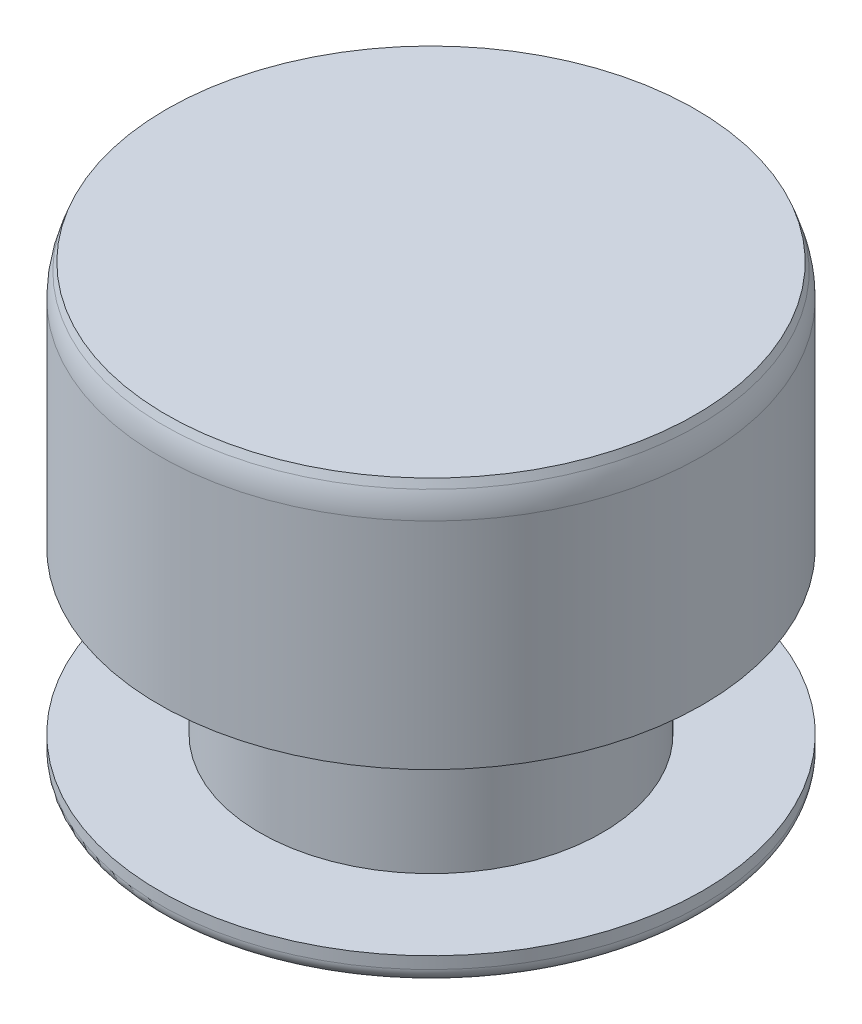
ISO-10303-21;
HEADER;
FILE_DESCRIPTION(('STEP AP214'),'2;1');
FILE_NAME('part.step','',(''),(''),'','','');
FILE_SCHEMA(('AUTOMOTIVE_DESIGN { 1 0 10303 214 1 1 1 1 }'));
ENDSEC;
DATA;
#1=APPLICATION_CONTEXT('core data for automotive mechanical design processes');
#2=APPLICATION_PROTOCOL_DEFINITION('international standard','automotive_design',2000,#1);
#3=PRODUCT_CONTEXT('',#1,'mechanical');
#4=PRODUCT('Part','Part','',(#3));
#5=PRODUCT_RELATED_PRODUCT_CATEGORY('part','',(#4));
#6=PRODUCT_DEFINITION_FORMATION('','',#4);
#7=PRODUCT_DEFINITION_CONTEXT('part definition',#1,'design');
#8=PRODUCT_DEFINITION('design','',#6,#7);
#9=PRODUCT_DEFINITION_SHAPE('','',#8);
#10=(LENGTH_UNIT() NAMED_UNIT(*) SI_UNIT(.MILLI.,.METRE.));
#11=(NAMED_UNIT(*) PLANE_ANGLE_UNIT() SI_UNIT($,.RADIAN.));
#12=(NAMED_UNIT(*) SI_UNIT($,.STERADIAN.) SOLID_ANGLE_UNIT());
#13=UNCERTAINTY_MEASURE_WITH_UNIT(LENGTH_MEASURE(1.E-05),#10,'distance_accuracy_value','');
#14=(GEOMETRIC_REPRESENTATION_CONTEXT(3) GLOBAL_UNCERTAINTY_ASSIGNED_CONTEXT((#13)) GLOBAL_UNIT_ASSIGNED_CONTEXT((#10,
#11,#12)) REPRESENTATION_CONTEXT('',''));
#15=CARTESIAN_POINT('',(0.,0.,0.));
#16=DIRECTION('',(0.,0.,1.));
#17=DIRECTION('',(1.,0.,0.));
#18=AXIS2_PLACEMENT_3D('',#15,#16,#17);
#19=CARTESIAN_POINT('',(3.71,0.,0.));
#20=DIRECTION('',(0.,-1.,0.));
#21=DIRECTION('',(1.,0.,0.));
#22=AXIS2_PLACEMENT_3D('',#19,#20,#21);
#23=PLANE('',#22);
#24=CARTESIAN_POINT('',(0.,0.,0.));
#25=DIRECTION('',(0.,1.,0.));
#26=DIRECTION('',(-1.,0.,0.));
#27=AXIS2_PLACEMENT_3D('',#24,#25,#26);
#28=CIRCLE('',#27,3.71);
#29=CARTESIAN_POINT('',(-3.71,0.,0.));
#30=VERTEX_POINT('',#29);
#31=EDGE_CURVE('E70',#30,#30,#28,.T.);
#32=ORIENTED_EDGE('',*,*,#31,.T.);
#33=EDGE_LOOP('',(#32));
#34=FACE_BOUND('',#33,.T.);
#35=ADVANCED_FACE('F35',(#34),#23,.F.);
#36=CARTESIAN_POINT('',(0.500000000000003,-7.99956969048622,0.));
#37=DIRECTION('',(0.,1.,0.));
#38=DIRECTION('',(-1.,0.,0.));
#39=AXIS2_PLACEMENT_3D('',#36,#37,#38);
#40=PLANE('',#39);
#41=CARTESIAN_POINT('',(0.,-7.99956969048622,0.));
#42=DIRECTION('',(0.,1.,0.));
#43=DIRECTION('',(-1.,0.,0.));
#44=AXIS2_PLACEMENT_3D('',#41,#42,#43);
#45=CIRCLE('',#44,0.5);
#46=CARTESIAN_POINT('',(-0.499999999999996,-7.99956969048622,0.));
#47=VERTEX_POINT('',#46);
#48=EDGE_CURVE('E55',#47,#47,#45,.T.);
#49=ORIENTED_EDGE('',*,*,#48,.F.);
#50=EDGE_LOOP('',(#49));
#51=FACE_BOUND('',#50,.T.);
#52=ADVANCED_FACE('F88',(#51),#40,.F.);
#53=CARTESIAN_POINT('',(0.,-7.99956969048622,0.));
#54=DIRECTION('',(0.,1.,0.));
#55=DIRECTION('',(-1.,0.,0.));
#56=AXIS2_PLACEMENT_3D('',#53,#54,#55);
#57=CONICAL_SURFACE('',#56,0.5,1.02974425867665);
#58=CARTESIAN_POINT('',(0.,-6.06899994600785,0.));
#59=DIRECTION('',(0.,-1.,0.));
#60=DIRECTION('',(1.,0.,0.));
#61=AXIS2_PLACEMENT_3D('',#58,#59,#60);
#62=CIRCLE('',#61,3.71300761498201);
#63=CARTESIAN_POINT('',(-3.71300761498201,-6.06899994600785,0.));
#64=VERTEX_POINT('',#63);
#65=EDGE_CURVE('E46',#64,#64,#62,.T.);
#66=CARTESIAN_POINT('',(-3.71300761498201,-6.06899994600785,0.));
#67=CARTESIAN_POINT('',(-3.67953878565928,-6.08911004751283,0.));
#68=CARTESIAN_POINT('',(-3.64606995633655,-6.10922014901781,0.));
#69=CARTESIAN_POINT('',(-3.57913229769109,-6.14944035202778,0.));
#70=CARTESIAN_POINT('',(-3.54566346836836,-6.16955045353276,0.));
#71=CARTESIAN_POINT('',(-3.4787258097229,-6.20977065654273,0.));
#72=CARTESIAN_POINT('',(-3.44525698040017,-6.22988075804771,0.));
#73=CARTESIAN_POINT('',(-3.37831932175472,-6.27010096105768,0.));
#74=CARTESIAN_POINT('',(-3.34485049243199,-6.29021106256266,0.));
#75=CARTESIAN_POINT('',(-3.27791283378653,-6.33043126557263,0.));
#76=CARTESIAN_POINT('',(-3.2444440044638,-6.35054136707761,0.));
#77=CARTESIAN_POINT('',(-3.17750634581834,-6.39076157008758,0.));
#78=CARTESIAN_POINT('',(-3.14403751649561,-6.41087167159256,0.));
#79=CARTESIAN_POINT('',(-3.07709985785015,-6.45109187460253,0.));
#80=CARTESIAN_POINT('',(-3.04363102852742,-6.47120197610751,0.));
#81=CARTESIAN_POINT('',(-2.97669336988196,-6.51142217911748,0.));
#82=CARTESIAN_POINT('',(-2.94322454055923,-6.53153228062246,0.));
#83=CARTESIAN_POINT('',(-2.87628688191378,-6.57175248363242,0.));
#84=CARTESIAN_POINT('',(-2.84281805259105,-6.59186258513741,0.));
#85=CARTESIAN_POINT('',(-2.77588039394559,-6.63208278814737,0.));
#86=CARTESIAN_POINT('',(-2.74241156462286,-6.65219288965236,0.));
#87=CARTESIAN_POINT('',(-2.6754739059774,-6.69241309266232,0.));
#88=CARTESIAN_POINT('',(-2.64200507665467,-6.71252319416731,0.));
#89=CARTESIAN_POINT('',(-2.57506741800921,-6.75274339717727,0.));
#90=CARTESIAN_POINT('',(-2.54159858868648,-6.77285349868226,0.));
#91=CARTESIAN_POINT('',(-2.47466093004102,-6.81307370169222,0.));
#92=CARTESIAN_POINT('',(-2.44119210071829,-6.8331838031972,0.));
#93=CARTESIAN_POINT('',(-2.37425444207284,-6.87340400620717,0.));
#94=CARTESIAN_POINT('',(-2.34078561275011,-6.89351410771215,0.));
#95=CARTESIAN_POINT('',(-2.27384795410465,-6.93373431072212,0.));
#96=CARTESIAN_POINT('',(-2.24037912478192,-6.9538444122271,0.));
#97=CARTESIAN_POINT('',(-2.17344146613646,-6.99406461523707,0.));
#98=CARTESIAN_POINT('',(-2.13997263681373,-7.01417471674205,0.));
#99=CARTESIAN_POINT('',(-2.07303497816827,-7.05439491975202,0.));
#100=CARTESIAN_POINT('',(-2.03956614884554,-7.074505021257,0.));
#101=CARTESIAN_POINT('',(-1.97262849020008,-7.11472522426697,0.));
#102=CARTESIAN_POINT('',(-1.93915966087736,-7.13483532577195,0.));
#103=CARTESIAN_POINT('',(-1.8722220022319,-7.17505552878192,0.));
#104=CARTESIAN_POINT('',(-1.83875317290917,-7.1951656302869,0.));
#105=CARTESIAN_POINT('',(-1.77181551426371,-7.23538583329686,0.));
#106=CARTESIAN_POINT('',(-1.73834668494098,-7.25549593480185,0.));
#107=CARTESIAN_POINT('',(-1.67140902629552,-7.29571613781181,0.));
#108=CARTESIAN_POINT('',(-1.63794019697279,-7.3158262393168,0.));
#109=CARTESIAN_POINT('',(-1.57100253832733,-7.35604644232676,0.));
#110=CARTESIAN_POINT('',(-1.5375337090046,-7.37615654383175,0.));
#111=CARTESIAN_POINT('',(-1.47059605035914,-7.41637674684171,0.));
#112=CARTESIAN_POINT('',(-1.43712722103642,-7.43648684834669,0.));
#113=CARTESIAN_POINT('',(-1.37018956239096,-7.47670705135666,0.));
#114=CARTESIAN_POINT('',(-1.33672073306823,-7.49681715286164,0.));
#115=CARTESIAN_POINT('',(-1.26978307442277,-7.53703735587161,0.));
#116=CARTESIAN_POINT('',(-1.23631424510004,-7.55714745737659,0.));
#117=CARTESIAN_POINT('',(-1.16937658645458,-7.59736766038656,0.));
#118=CARTESIAN_POINT('',(-1.13590775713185,-7.61747776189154,0.));
#119=CARTESIAN_POINT('',(-1.06897009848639,-7.65769796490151,0.));
#120=CARTESIAN_POINT('',(-1.03550126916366,-7.67780806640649,0.));
#121=CARTESIAN_POINT('',(-0.968563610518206,-7.71802826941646,0.));
#122=CARTESIAN_POINT('',(-0.935094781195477,-7.73813837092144,0.));
#123=CARTESIAN_POINT('',(-0.868157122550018,-7.77835857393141,0.));
#124=CARTESIAN_POINT('',(-0.834688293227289,-7.79846867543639,0.));
#125=CARTESIAN_POINT('',(-0.76775063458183,-7.83868887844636,0.));
#126=CARTESIAN_POINT('',(-0.734281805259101,-7.85879897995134,0.));
#127=CARTESIAN_POINT('',(-0.667344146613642,-7.89901918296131,0.));
#128=CARTESIAN_POINT('',(-0.633875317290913,-7.91912928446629,0.));
#129=CARTESIAN_POINT('',(-0.566937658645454,-7.95934948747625,0.));
#130=CARTESIAN_POINT('',(-0.533468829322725,-7.97945958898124,0.));
#131=CARTESIAN_POINT('',(-0.499999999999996,-7.99956969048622,0.));
#132=B_SPLINE_CURVE_WITH_KNOTS('',3,(#66,#67,#68,#69,#70,#71,#72,#73,#74,#75,#76,#77,#78,#79,
#80,#81,#82,#83,#84,#85,#86,#87,#88,#89,#90,#91,#92,#93,#94,#95,#96,#97,#98,#99,#100,#101,#102,
#103,#104,#105,#106,#107,#108,#109,#110,#111,#112,#113,#114,#115,#116,#117,#118,#119,#120,#121,
#122,#123,#124,#125,#126,#127,#128,#129,#130,#131),.UNSPECIFIED.,.F.,.F.,(4,2,2,2,2,2,2,2,2,2,2,
2,2,2,2,2,2,2,2,2,2,2,2,2,2,2,2,2,2,2,2,2,4),(0.,0.117137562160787,0.234275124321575,
0.351412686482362,0.46855024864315,0.585687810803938,0.702825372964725,0.819962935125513,
0.9371004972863,1.05423805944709,1.17137562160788,1.28851318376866,1.40565074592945,
1.52278830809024,1.63992587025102,1.75706343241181,1.8742009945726,1.99133855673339,
2.10847611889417,2.22561368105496,2.34275124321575,2.45988880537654,2.57702636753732,
2.69416392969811,2.8113014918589,2.92843905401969,3.04557661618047,3.16271417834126,
3.27985174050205,3.39698930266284,3.51412686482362,3.63126442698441,3.7484019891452),.UNSPECIFIED.);
#133=EDGE_CURVE('BSEAM93',#64,#47,#132,.T.);
#134=ORIENTED_EDGE('',*,*,#65,.T.);
#135=ORIENTED_EDGE('',*,*,#48,.T.);
#136=ORIENTED_EDGE('',*,*,#133,.T.);
#137=ORIENTED_EDGE('',*,*,#133,.F.);
#138=EDGE_LOOP('',(#134,#136,#135,#137));
#139=FACE_BOUND('',#138,.T.);
#140=ADVANCED_FACE('F93',(#139),#57,.T.);
#141=CARTESIAN_POINT('',(0.,0.,0.));
#142=DIRECTION('',(0.,1.,0.));
#143=DIRECTION('',(-1.,0.,0.));
#144=AXIS2_PLACEMENT_3D('',#141,#142,#143);
#145=CYLINDRICAL_SURFACE('',#144,3.81);
#146=CARTESIAN_POINT('',(0.,-5.89756648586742,0.));
#147=DIRECTION('',(0.,-1.,0.));
#148=DIRECTION('',(1.,0.,0.));
#149=AXIS2_PLACEMENT_3D('',#146,#147,#148);
#150=CIRCLE('',#149,3.81);
#151=CARTESIAN_POINT('',(3.81,-5.89756648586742,0.));
#152=VERTEX_POINT('',#151);
#153=EDGE_CURVE('E50',#152,#152,#150,.F.);
#154=ORIENTED_EDGE('',*,*,#153,.T.);
#155=EDGE_LOOP('',(#154));
#156=FACE_BOUND('',#155,.T.);
#157=CARTESIAN_POINT('',(0.,-5.73,0.));
#158=DIRECTION('',(0.,1.,0.));
#159=DIRECTION('',(-1.,0.,0.));
#160=AXIS2_PLACEMENT_3D('',#157,#158,#159);
#161=CIRCLE('',#160,3.81);
#162=CARTESIAN_POINT('',(-3.81,-5.73,0.));
#163=VERTEX_POINT('',#162);
#164=EDGE_CURVE('E58',#163,#163,#161,.T.);
#165=ORIENTED_EDGE('',*,*,#164,.F.);
#166=EDGE_LOOP('',(#165));
#167=FACE_BOUND('',#166,.T.);
#168=ADVANCED_FACE('F99',(#156,#167),#145,.T.);
#169=CARTESIAN_POINT('',(3.81,-5.73,0.));
#170=DIRECTION('',(0.,-1.,0.));
#171=DIRECTION('',(1.,0.,0.));
#172=AXIS2_PLACEMENT_3D('',#169,#170,#171);
#173=PLANE('',#172);
#174=CARTESIAN_POINT('',(0.,-5.73,0.));
#175=DIRECTION('',(0.,1.,0.));
#176=DIRECTION('',(-1.,0.,0.));
#177=AXIS2_PLACEMENT_3D('',#174,#175,#176);
#178=CIRCLE('',#177,2.4);
#179=CARTESIAN_POINT('',(-2.4,-5.73,0.));
#180=VERTEX_POINT('',#179);
#181=EDGE_CURVE('E61',#180,#180,#178,.T.);
#182=ORIENTED_EDGE('',*,*,#181,.F.);
#183=EDGE_LOOP('',(#182));
#184=FACE_BOUND('',#183,.T.);
#185=ORIENTED_EDGE('',*,*,#164,.T.);
#186=EDGE_LOOP('',(#185));
#187=FACE_BOUND('',#186,.T.);
#188=ADVANCED_FACE('F103',(#184,#187),#173,.F.);
#189=CARTESIAN_POINT('',(0.,0.,0.));
#190=DIRECTION('',(0.,1.,0.));
#191=DIRECTION('',(-1.,0.,0.));
#192=AXIS2_PLACEMENT_3D('',#189,#190,#191);
#193=CYLINDRICAL_SURFACE('',#192,2.4);
#194=CARTESIAN_POINT('',(0.,-3.47,0.));
#195=DIRECTION('',(0.,1.,0.));
#196=DIRECTION('',(-1.,0.,0.));
#197=AXIS2_PLACEMENT_3D('',#194,#195,#196);
#198=CIRCLE('',#197,2.4);
#199=CARTESIAN_POINT('',(-2.4,-3.47,0.));
#200=VERTEX_POINT('',#199);
#201=EDGE_CURVE('E64',#200,#200,#198,.T.);
#202=ORIENTED_EDGE('',*,*,#201,.F.);
#203=EDGE_LOOP('',(#202));
#204=FACE_BOUND('',#203,.T.);
#205=ORIENTED_EDGE('',*,*,#181,.T.);
#206=EDGE_LOOP('',(#205));
#207=FACE_BOUND('',#206,.T.);
#208=ADVANCED_FACE('F107',(#204,#207),#193,.T.);
#209=CARTESIAN_POINT('',(2.4,-3.47,0.));
#210=DIRECTION('',(0.,1.,0.));
#211=DIRECTION('',(-1.,0.,0.));
#212=AXIS2_PLACEMENT_3D('',#209,#210,#211);
#213=PLANE('',#212);
#214=CARTESIAN_POINT('',(0.,-3.47,0.));
#215=DIRECTION('',(0.,1.,0.));
#216=DIRECTION('',(-1.,0.,0.));
#217=AXIS2_PLACEMENT_3D('',#214,#215,#216);
#218=CIRCLE('',#217,3.81);
#219=CARTESIAN_POINT('',(-3.81,-3.47,0.));
#220=VERTEX_POINT('',#219);
#221=EDGE_CURVE('E67',#220,#220,#218,.T.);
#222=ORIENTED_EDGE('',*,*,#221,.F.);
#223=EDGE_LOOP('',(#222));
#224=FACE_BOUND('',#223,.T.);
#225=ORIENTED_EDGE('',*,*,#201,.T.);
#226=EDGE_LOOP('',(#225));
#227=FACE_BOUND('',#226,.T.);
#228=ADVANCED_FACE('F85',(#224,#227),#213,.F.);
#229=CARTESIAN_POINT('',(0.,0.,0.));
#230=DIRECTION('',(0.,1.,0.));
#231=DIRECTION('',(-1.,0.,0.));
#232=AXIS2_PLACEMENT_3D('',#229,#230,#231);
#233=CYLINDRICAL_SURFACE('',#232,3.81);
#234=CARTESIAN_POINT('',(0.,-0.451074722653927,0.));
#235=DIRECTION('',(0.,-1.,0.));
#236=DIRECTION('',(1.,0.,0.));
#237=AXIS2_PLACEMENT_3D('',#234,#235,#236);
#238=CIRCLE('',#237,3.81);
#239=CARTESIAN_POINT('',(3.81,-0.451074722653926,0.));
#240=VERTEX_POINT('',#239);
#241=EDGE_CURVE('E10',#240,#240,#238,.T.);
#242=ORIENTED_EDGE('',*,*,#241,.T.);
#243=EDGE_LOOP('',(#242));
#244=FACE_BOUND('',#243,.T.);
#245=ORIENTED_EDGE('',*,*,#221,.T.);
#246=EDGE_LOOP('',(#245));
#247=FACE_BOUND('',#246,.T.);
#248=ADVANCED_FACE('F78',(#244,#247),#233,.T.);
#249=CARTESIAN_POINT('',(0.,-0.274747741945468,0.));
#250=DIRECTION('',(0.,-1.,0.));
#251=DIRECTION('',(1.,0.,0.));
#252=AXIS2_PLACEMENT_3D('',#249,#250,#251);
#253=CONICAL_SURFACE('',#252,3.81,0.34906585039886);
#254=CARTESIAN_POINT('',(0.,-0.109054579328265,0.));
#255=DIRECTION('',(0.,1.,0.));
#256=DIRECTION('',(-1.,0.,0.));
#257=AXIS2_PLACEMENT_3D('',#254,#255,#256);
#258=CIRCLE('',#257,3.74969262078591);
#259=CARTESIAN_POINT('',(-3.74969262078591,-0.109054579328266,0.));
#260=VERTEX_POINT('',#259);
#261=EDGE_CURVE('E42',#260,#260,#258,.T.);
#262=ORIENTED_EDGE('',*,*,#261,.T.);
#263=EDGE_LOOP('',(#262));
#264=FACE_BOUND('',#263,.T.);
#265=ORIENTED_EDGE('',*,*,#31,.F.);
#266=EDGE_LOOP('',(#265));
#267=FACE_BOUND('',#266,.T.);
#268=ADVANCED_FACE('F75',(#264,#267),#253,.T.);
#269=CARTESIAN_POINT('',(0.,-5.89756648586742,0.));
#270=DIRECTION('',(0.,-1.,0.));
#271=DIRECTION('',(1.,0.,0.));
#272=AXIS2_PLACEMENT_3D('',#269,#270,#271);
#273=TOROIDAL_SURFACE('',#272,3.61,0.2);
#274=ORIENTED_EDGE('',*,*,#65,.F.);
#275=EDGE_LOOP('',(#274));
#276=FACE_BOUND('',#275,.T.);
#277=ORIENTED_EDGE('',*,*,#153,.F.);
#278=EDGE_LOOP('',(#277));
#279=FACE_BOUND('',#278,.T.);
#280=ADVANCED_FACE('F77',(#276,#279),#273,.T.);
#281=CARTESIAN_POINT('',(0.,-0.451074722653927,0.));
#282=DIRECTION('',(0.,-1.,0.));
#283=DIRECTION('',(1.,0.,0.));
#284=AXIS2_PLACEMENT_3D('',#281,#282,#283);
#285=TOROIDAL_SURFACE('',#284,2.81,1.);
#286=ORIENTED_EDGE('',*,*,#241,.F.);
#287=EDGE_LOOP('',(#286));
#288=FACE_BOUND('',#287,.T.);
#289=ORIENTED_EDGE('',*,*,#261,.F.);
#290=EDGE_LOOP('',(#289));
#291=FACE_BOUND('',#290,.T.);
#292=ADVANCED_FACE('F37',(#288,#291),#285,.T.);
#293=CLOSED_SHELL('',(#35,#52,#140,#168,#188,#208,#228,#248,#268,#280,#292));
#294=MANIFOLD_SOLID_BREP('B2',#293);
#295=ADVANCED_BREP_SHAPE_REPRESENTATION('',(#18,#294),#14);
#296=SHAPE_DEFINITION_REPRESENTATION(#9,#295);
ENDSEC;
END-ISO-10303-21;
